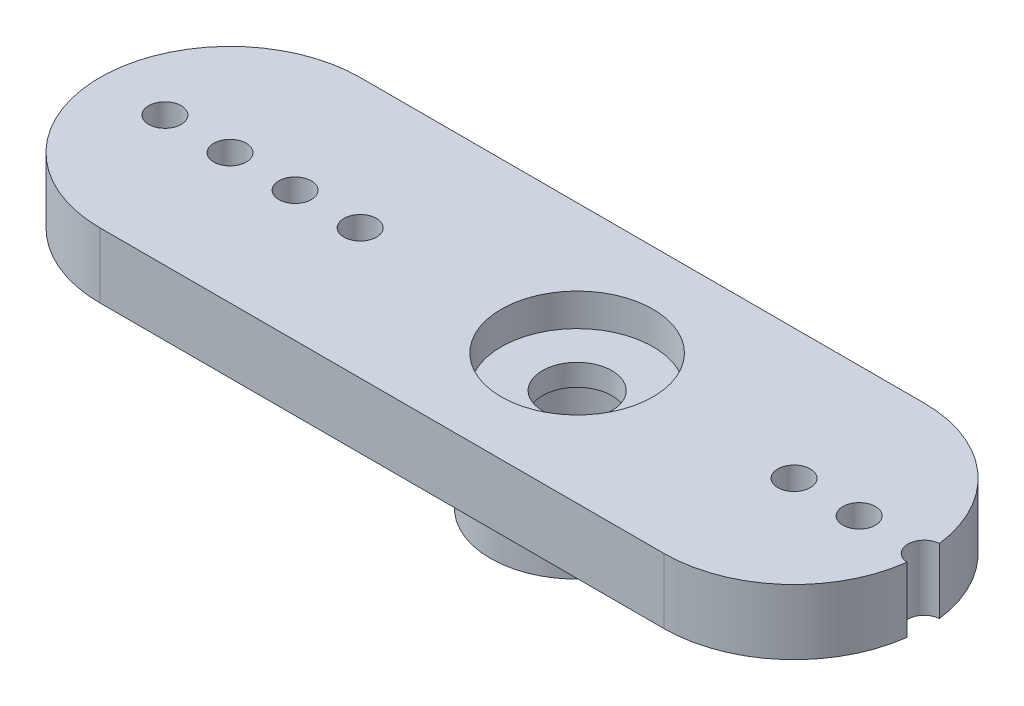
ISO-10303-21;
HEADER;
FILE_DESCRIPTION(('STEP AP214'),'2;1');
FILE_NAME('part.step','',(''),(''),'','','');
FILE_SCHEMA(('AUTOMOTIVE_DESIGN { 1 0 10303 214 1 1 1 1 }'));
ENDSEC;
DATA;
#1=APPLICATION_CONTEXT('core data for automotive mechanical design processes');
#2=APPLICATION_PROTOCOL_DEFINITION('international standard','automotive_design',2000,#1);
#3=PRODUCT_CONTEXT('',#1,'mechanical');
#4=PRODUCT('Part','Part','',(#3));
#5=PRODUCT_RELATED_PRODUCT_CATEGORY('part','',(#4));
#6=PRODUCT_DEFINITION_FORMATION('','',#4);
#7=PRODUCT_DEFINITION_CONTEXT('part definition',#1,'design');
#8=PRODUCT_DEFINITION('design','',#6,#7);
#9=PRODUCT_DEFINITION_SHAPE('','',#8);
#10=(LENGTH_UNIT() NAMED_UNIT(*) SI_UNIT(.MILLI.,.METRE.));
#11=(NAMED_UNIT(*) PLANE_ANGLE_UNIT() SI_UNIT($,.RADIAN.));
#12=(NAMED_UNIT(*) SI_UNIT($,.STERADIAN.) SOLID_ANGLE_UNIT());
#13=UNCERTAINTY_MEASURE_WITH_UNIT(LENGTH_MEASURE(1.E-05),#10,'distance_accuracy_value','');
#14=(GEOMETRIC_REPRESENTATION_CONTEXT(3) GLOBAL_UNCERTAINTY_ASSIGNED_CONTEXT((#13)) GLOBAL_UNIT_ASSIGNED_CONTEXT((#10,
#11,#12)) REPRESENTATION_CONTEXT('',''));
#15=CARTESIAN_POINT('',(0.,0.,0.));
#16=DIRECTION('',(0.,0.,1.));
#17=DIRECTION('',(1.,0.,0.));
#18=AXIS2_PLACEMENT_3D('',#15,#16,#17);
#19=CARTESIAN_POINT('',(-16.,3.,6.));
#20=DIRECTION('',(0.,0.,-1.));
#21=DIRECTION('',(-1.,0.,0.));
#22=AXIS2_PLACEMENT_3D('',#19,#20,#21);
#23=PLANE('',#22);
#24=DIRECTION('',(0.,1.,0.));
#25=VECTOR('',#24,1.);
#26=CARTESIAN_POINT('',(10.,-3.2,6.));
#27=LINE('',#26,#25);
#28=CARTESIAN_POINT('',(10.,0.,6.));
#29=VERTEX_POINT('',#28);
#30=CARTESIAN_POINT('',(10.,3.,6.));
#31=VERTEX_POINT('',#30);
#32=EDGE_CURVE('E88',#29,#31,#27,.T.);
#33=ORIENTED_EDGE('',*,*,#32,.T.);
#34=DIRECTION('',(1.,0.,0.));
#35=VECTOR('',#34,1.);
#36=CARTESIAN_POINT('',(-16.,3.,6.));
#37=LINE('',#36,#35);
#38=CARTESIAN_POINT('',(-16.,3.,6.));
#39=VERTEX_POINT('',#38);
#40=EDGE_CURVE('E97',#39,#31,#37,.T.);
#41=ORIENTED_EDGE('',*,*,#40,.F.);
#42=DIRECTION('',(0.,-1.,0.));
#43=VECTOR('',#42,1.);
#44=CARTESIAN_POINT('',(-16.,3.,6.));
#45=LINE('',#44,#43);
#46=CARTESIAN_POINT('',(-16.,0.,6.));
#47=VERTEX_POINT('',#46);
#48=EDGE_CURVE('E123',#39,#47,#45,.T.);
#49=ORIENTED_EDGE('',*,*,#48,.T.);
#50=DIRECTION('',(1.,0.,0.));
#51=VECTOR('',#50,1.);
#52=CARTESIAN_POINT('',(-16.,0.,6.));
#53=LINE('',#52,#51);
#54=EDGE_CURVE('E99',#47,#29,#53,.T.);
#55=ORIENTED_EDGE('',*,*,#54,.T.);
#56=EDGE_LOOP('',(#33,#41,#49,#55));
#57=FACE_BOUND('',#56,.T.);
#58=ADVANCED_FACE('F35',(#57),#23,.F.);
#59=CARTESIAN_POINT('',(-16.,3.,0.));
#60=DIRECTION('',(0.,-1.,0.));
#61=DIRECTION('',(0.,0.,-1.));
#62=AXIS2_PLACEMENT_3D('',#59,#60,#61);
#63=CYLINDRICAL_SURFACE('',#62,6.);
#64=CARTESIAN_POINT('',(-16.,0.,0.));
#65=DIRECTION('',(0.,1.,0.));
#66=DIRECTION('',(0.,0.,1.));
#67=AXIS2_PLACEMENT_3D('',#64,#65,#66);
#68=CIRCLE('',#67,6.);
#69=CARTESIAN_POINT('',(-16.,0.,-6.));
#70=VERTEX_POINT('',#69);
#71=EDGE_CURVE('E115',#70,#47,#68,.T.);
#72=ORIENTED_EDGE('',*,*,#71,.T.);
#73=ORIENTED_EDGE('',*,*,#48,.F.);
#74=CARTESIAN_POINT('',(-16.,3.,0.));
#75=DIRECTION('',(0.,1.,0.));
#76=DIRECTION('',(0.,0.,1.));
#77=AXIS2_PLACEMENT_3D('',#74,#75,#76);
#78=CIRCLE('',#77,6.);
#79=CARTESIAN_POINT('',(-16.,3.,-6.));
#80=VERTEX_POINT('',#79);
#81=EDGE_CURVE('E105',#80,#39,#78,.T.);
#82=ORIENTED_EDGE('',*,*,#81,.F.);
#83=DIRECTION('',(0.,-1.,0.));
#84=VECTOR('',#83,1.);
#85=CARTESIAN_POINT('',(-16.,3.,-6.));
#86=LINE('',#85,#84);
#87=EDGE_CURVE('E109',#80,#70,#86,.T.);
#88=ORIENTED_EDGE('',*,*,#87,.T.);
#89=EDGE_LOOP('',(#72,#73,#82,#88));
#90=FACE_BOUND('',#89,.T.);
#91=ADVANCED_FACE('F37',(#90),#63,.T.);
#92=CARTESIAN_POINT('',(-16.,3.,-6.));
#93=DIRECTION('',(0.,0.,1.));
#94=DIRECTION('',(1.,0.,0.));
#95=AXIS2_PLACEMENT_3D('',#92,#93,#94);
#96=PLANE('',#95);
#97=DIRECTION('',(-1.,0.,0.));
#98=VECTOR('',#97,1.);
#99=CARTESIAN_POINT('',(-16.,3.,-6.));
#100=LINE('',#99,#98);
#101=CARTESIAN_POINT('',(10.,3.,-6.));
#102=VERTEX_POINT('',#101);
#103=EDGE_CURVE('E107',#102,#80,#100,.T.);
#104=ORIENTED_EDGE('',*,*,#103,.F.);
#105=DIRECTION('',(0.,1.,0.));
#106=VECTOR('',#105,1.);
#107=CARTESIAN_POINT('',(10.,-3.2,-6.));
#108=LINE('',#107,#106);
#109=CARTESIAN_POINT('',(10.,0.,-6.));
#110=VERTEX_POINT('',#109);
#111=EDGE_CURVE('E100',#110,#102,#108,.T.);
#112=ORIENTED_EDGE('',*,*,#111,.F.);
#113=DIRECTION('',(-1.,0.,0.));
#114=VECTOR('',#113,1.);
#115=CARTESIAN_POINT('',(-16.,0.,-6.));
#116=LINE('',#115,#114);
#117=EDGE_CURVE('E111',#110,#70,#116,.T.);
#118=ORIENTED_EDGE('',*,*,#117,.T.);
#119=ORIENTED_EDGE('',*,*,#87,.F.);
#120=EDGE_LOOP('',(#104,#112,#118,#119));
#121=FACE_BOUND('',#120,.T.);
#122=ADVANCED_FACE('F187',(#121),#96,.F.);
#123=CARTESIAN_POINT('',(-16.,3.,0.));
#124=DIRECTION('',(0.,1.,0.));
#125=DIRECTION('',(0.,0.,1.));
#126=AXIS2_PLACEMENT_3D('',#123,#124,#125);
#127=PLANE('',#126);
#128=CARTESIAN_POINT('',(10.,3.,0.));
#129=DIRECTION('',(0.,-1.,0.));
#130=DIRECTION('',(0.,0.,1.));
#131=AXIS2_PLACEMENT_3D('',#128,#129,#130);
#132=CIRCLE('',#131,6.);
#133=CARTESIAN_POINT('',(15.953125,3.,-0.74853372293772));
#134=VERTEX_POINT('',#133);
#135=EDGE_CURVE('E50',#102,#134,#132,.T.);
#136=ORIENTED_EDGE('',*,*,#135,.F.);
#137=ORIENTED_EDGE('',*,*,#103,.T.);
#138=ORIENTED_EDGE('',*,*,#81,.T.);
#139=ORIENTED_EDGE('',*,*,#40,.T.);
#140=CARTESIAN_POINT('',(15.953125,3.,0.748533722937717));
#141=VERTEX_POINT('',#140);
#142=EDGE_CURVE('E85',#141,#31,#132,.T.);
#143=ORIENTED_EDGE('',*,*,#142,.F.);
#144=CARTESIAN_POINT('',(16.,3.,0.));
#145=DIRECTION('',(0.,1.,0.));
#146=DIRECTION('',(0.,0.,1.));
#147=AXIS2_PLACEMENT_3D('',#144,#145,#146);
#148=CIRCLE('',#147,0.750000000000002);
#149=EDGE_CURVE('E130',#134,#141,#148,.T.);
#150=ORIENTED_EDGE('',*,*,#149,.F.);
#151=EDGE_LOOP('',(#136,#137,#138,#139,#143,#150));
#152=FACE_BOUND('',#151,.T.);
#153=CARTESIAN_POINT('',(0.,3.,0.));
#154=DIRECTION('',(0.,1.,0.));
#155=DIRECTION('',(0.,0.,1.));
#156=AXIS2_PLACEMENT_3D('',#153,#154,#155);
#157=CIRCLE('',#156,3.5);
#158=CARTESIAN_POINT('',(0.,3.,3.5));
#159=VERTEX_POINT('',#158);
#160=EDGE_CURVE('E221',#159,#159,#157,.T.);
#161=ORIENTED_EDGE('',*,*,#160,.F.);
#162=EDGE_LOOP('',(#161));
#163=FACE_BOUND('',#162,.T.);
#164=CARTESIAN_POINT('',(-16.,3.,0.));
#165=DIRECTION('',(0.,1.,0.));
#166=DIRECTION('',(0.,0.,1.));
#167=AXIS2_PLACEMENT_3D('',#164,#165,#166);
#168=CIRCLE('',#167,0.750000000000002);
#169=CARTESIAN_POINT('',(-16.,3.,0.750000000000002));
#170=VERTEX_POINT('',#169);
#171=EDGE_CURVE('E151',#170,#170,#168,.T.);
#172=ORIENTED_EDGE('',*,*,#171,.F.);
#173=EDGE_LOOP('',(#172));
#174=FACE_BOUND('',#173,.T.);
#175=CARTESIAN_POINT('',(-13.,3.,0.));
#176=DIRECTION('',(0.,1.,0.));
#177=DIRECTION('',(0.,0.,1.));
#178=AXIS2_PLACEMENT_3D('',#175,#176,#177);
#179=CIRCLE('',#178,0.75);
#180=CARTESIAN_POINT('',(-13.,3.,0.75));
#181=VERTEX_POINT('',#180);
#182=EDGE_CURVE('E162',#181,#181,#179,.T.);
#183=ORIENTED_EDGE('',*,*,#182,.F.);
#184=EDGE_LOOP('',(#183));
#185=FACE_BOUND('',#184,.T.);
#186=CARTESIAN_POINT('',(-10.,3.,0.));
#187=DIRECTION('',(0.,1.,0.));
#188=DIRECTION('',(0.,0.,1.));
#189=AXIS2_PLACEMENT_3D('',#186,#187,#188);
#190=CIRCLE('',#189,0.75);
#191=CARTESIAN_POINT('',(-10.,3.,0.75));
#192=VERTEX_POINT('',#191);
#193=EDGE_CURVE('E168',#192,#192,#190,.T.);
#194=ORIENTED_EDGE('',*,*,#193,.F.);
#195=EDGE_LOOP('',(#194));
#196=FACE_BOUND('',#195,.T.);
#197=CARTESIAN_POINT('',(10.,3.,0.));
#198=DIRECTION('',(0.,1.,0.));
#199=DIRECTION('',(0.,0.,1.));
#200=AXIS2_PLACEMENT_3D('',#197,#198,#199);
#201=CIRCLE('',#200,0.75);
#202=CARTESIAN_POINT('',(10.,3.,0.75));
#203=VERTEX_POINT('',#202);
#204=EDGE_CURVE('E174',#203,#203,#201,.T.);
#205=ORIENTED_EDGE('',*,*,#204,.F.);
#206=EDGE_LOOP('',(#205));
#207=FACE_BOUND('',#206,.T.);
#208=CARTESIAN_POINT('',(13.,3.,0.));
#209=DIRECTION('',(0.,1.,0.));
#210=DIRECTION('',(0.,0.,1.));
#211=AXIS2_PLACEMENT_3D('',#208,#209,#210);
#212=CIRCLE('',#211,0.750000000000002);
#213=CARTESIAN_POINT('',(13.,3.,0.750000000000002));
#214=VERTEX_POINT('',#213);
#215=EDGE_CURVE('E137',#214,#214,#212,.T.);
#216=ORIENTED_EDGE('',*,*,#215,.F.);
#217=EDGE_LOOP('',(#216));
#218=FACE_BOUND('',#217,.T.);
#219=CARTESIAN_POINT('',(-19.,3.,0.));
#220=DIRECTION('',(0.,1.,0.));
#221=DIRECTION('',(0.,0.,1.));
#222=AXIS2_PLACEMENT_3D('',#219,#220,#221);
#223=CIRCLE('',#222,0.750000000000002);
#224=CARTESIAN_POINT('',(-19.,3.,0.750000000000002));
#225=VERTEX_POINT('',#224);
#226=EDGE_CURVE('E145',#225,#225,#223,.T.);
#227=ORIENTED_EDGE('',*,*,#226,.F.);
#228=EDGE_LOOP('',(#227));
#229=FACE_BOUND('',#228,.T.);
#230=ADVANCED_FACE('F102',(#152,#163,#174,#185,#196,#207,#218,#229),#127,.T.);
#231=CARTESIAN_POINT('',(-16.,0.,0.));
#232=DIRECTION('',(0.,1.,0.));
#233=DIRECTION('',(0.,0.,1.));
#234=AXIS2_PLACEMENT_3D('',#231,#232,#233);
#235=PLANE('',#234);
#236=CARTESIAN_POINT('',(0.,0.,0.));
#237=DIRECTION('',(0.,1.,0.));
#238=DIRECTION('',(0.,0.,1.));
#239=AXIS2_PLACEMENT_3D('',#236,#237,#238);
#240=CIRCLE('',#239,4.);
#241=CARTESIAN_POINT('',(0.,0.,4.));
#242=VERTEX_POINT('',#241);
#243=EDGE_CURVE('E125',#242,#242,#240,.F.);
#244=ORIENTED_EDGE('',*,*,#243,.F.);
#245=EDGE_LOOP('',(#244));
#246=FACE_BOUND('',#245,.T.);
#247=CARTESIAN_POINT('',(-16.,0.,0.));
#248=DIRECTION('',(0.,1.,0.));
#249=DIRECTION('',(0.,0.,1.));
#250=AXIS2_PLACEMENT_3D('',#247,#248,#249);
#251=CIRCLE('',#250,0.750000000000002);
#252=CARTESIAN_POINT('',(-16.,0.,0.750000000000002));
#253=VERTEX_POINT('',#252);
#254=EDGE_CURVE('E147',#253,#253,#251,.T.);
#255=ORIENTED_EDGE('',*,*,#254,.T.);
#256=EDGE_LOOP('',(#255));
#257=FACE_BOUND('',#256,.T.);
#258=CARTESIAN_POINT('',(-13.,0.,0.));
#259=DIRECTION('',(0.,1.,0.));
#260=DIRECTION('',(0.,0.,1.));
#261=AXIS2_PLACEMENT_3D('',#258,#259,#260);
#262=CIRCLE('',#261,0.75);
#263=CARTESIAN_POINT('',(-13.,0.,0.75));
#264=VERTEX_POINT('',#263);
#265=EDGE_CURVE('E156',#264,#264,#262,.T.);
#266=ORIENTED_EDGE('',*,*,#265,.T.);
#267=EDGE_LOOP('',(#266));
#268=FACE_BOUND('',#267,.T.);
#269=CARTESIAN_POINT('',(-10.,0.,0.));
#270=DIRECTION('',(0.,1.,0.));
#271=DIRECTION('',(0.,0.,1.));
#272=AXIS2_PLACEMENT_3D('',#269,#270,#271);
#273=CIRCLE('',#272,0.75);
#274=CARTESIAN_POINT('',(-10.,0.,0.75));
#275=VERTEX_POINT('',#274);
#276=EDGE_CURVE('E165',#275,#275,#273,.T.);
#277=ORIENTED_EDGE('',*,*,#276,.T.);
#278=EDGE_LOOP('',(#277));
#279=FACE_BOUND('',#278,.T.);
#280=CARTESIAN_POINT('',(10.,0.,0.));
#281=DIRECTION('',(0.,1.,0.));
#282=DIRECTION('',(0.,0.,1.));
#283=AXIS2_PLACEMENT_3D('',#280,#281,#282);
#284=CIRCLE('',#283,0.75);
#285=CARTESIAN_POINT('',(10.,0.,0.75));
#286=VERTEX_POINT('',#285);
#287=EDGE_CURVE('E171',#286,#286,#284,.T.);
#288=ORIENTED_EDGE('',*,*,#287,.T.);
#289=EDGE_LOOP('',(#288));
#290=FACE_BOUND('',#289,.T.);
#291=CARTESIAN_POINT('',(13.,0.,0.));
#292=DIRECTION('',(0.,1.,0.));
#293=DIRECTION('',(0.,0.,1.));
#294=AXIS2_PLACEMENT_3D('',#291,#292,#293);
#295=CIRCLE('',#294,0.750000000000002);
#296=CARTESIAN_POINT('',(13.,0.,0.750000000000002));
#297=VERTEX_POINT('',#296);
#298=EDGE_CURVE('E177',#297,#297,#295,.T.);
#299=ORIENTED_EDGE('',*,*,#298,.T.);
#300=EDGE_LOOP('',(#299));
#301=FACE_BOUND('',#300,.T.);
#302=ORIENTED_EDGE('',*,*,#117,.F.);
#303=CARTESIAN_POINT('',(10.,0.,0.));
#304=DIRECTION('',(0.,1.,0.));
#305=DIRECTION('',(0.,0.,1.));
#306=AXIS2_PLACEMENT_3D('',#303,#304,#305);
#307=CIRCLE('',#306,6.);
#308=CARTESIAN_POINT('',(15.953125,0.,-0.74853372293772));
#309=VERTEX_POINT('',#308);
#310=EDGE_CURVE('E212',#110,#309,#307,.F.);
#311=ORIENTED_EDGE('',*,*,#310,.T.);
#312=CARTESIAN_POINT('',(16.,0.,0.));
#313=DIRECTION('',(0.,1.,0.));
#314=DIRECTION('',(0.,0.,1.));
#315=AXIS2_PLACEMENT_3D('',#312,#313,#314);
#316=CIRCLE('',#315,0.750000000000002);
#317=CARTESIAN_POINT('',(15.953125,0.,0.74853372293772));
#318=VERTEX_POINT('',#317);
#319=EDGE_CURVE('E132',#309,#318,#316,.T.);
#320=ORIENTED_EDGE('',*,*,#319,.T.);
#321=EDGE_CURVE('E58',#318,#29,#307,.F.);
#322=ORIENTED_EDGE('',*,*,#321,.T.);
#323=ORIENTED_EDGE('',*,*,#54,.F.);
#324=ORIENTED_EDGE('',*,*,#71,.F.);
#325=EDGE_LOOP('',(#302,#311,#320,#322,#323,#324));
#326=FACE_BOUND('',#325,.T.);
#327=CARTESIAN_POINT('',(-19.,0.,0.));
#328=DIRECTION('',(0.,1.,0.));
#329=DIRECTION('',(0.,0.,1.));
#330=AXIS2_PLACEMENT_3D('',#327,#328,#329);
#331=CIRCLE('',#330,0.750000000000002);
#332=CARTESIAN_POINT('',(-19.,0.,0.750000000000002));
#333=VERTEX_POINT('',#332);
#334=EDGE_CURVE('E118',#333,#333,#331,.T.);
#335=ORIENTED_EDGE('',*,*,#334,.T.);
#336=EDGE_LOOP('',(#335));
#337=FACE_BOUND('',#336,.T.);
#338=ADVANCED_FACE('F186',(#246,#257,#268,#279,#290,#301,#326,#337),#235,.F.);
#339=CARTESIAN_POINT('',(-19.,0.,0.));
#340=DIRECTION('',(0.,1.,0.));
#341=DIRECTION('',(0.,0.,1.));
#342=AXIS2_PLACEMENT_3D('',#339,#340,#341);
#343=CYLINDRICAL_SURFACE('',#342,0.750000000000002);
#344=ORIENTED_EDGE('',*,*,#334,.F.);
#345=EDGE_LOOP('',(#344));
#346=FACE_BOUND('',#345,.T.);
#347=ORIENTED_EDGE('',*,*,#226,.T.);
#348=EDGE_LOOP('',(#347));
#349=FACE_BOUND('',#348,.T.);
#350=ADVANCED_FACE('F193',(#346,#349),#343,.F.);
#351=CARTESIAN_POINT('',(16.,0.,0.));
#352=DIRECTION('',(0.,1.,0.));
#353=DIRECTION('',(0.,0.,1.));
#354=AXIS2_PLACEMENT_3D('',#351,#352,#353);
#355=CYLINDRICAL_SURFACE('',#354,0.750000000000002);
#356=ORIENTED_EDGE('',*,*,#149,.T.);
#357=DIRECTION('',(0.,1.,0.));
#358=VECTOR('',#357,1.);
#359=CARTESIAN_POINT('',(15.953125,-0.1,0.74853372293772));
#360=LINE('',#359,#358);
#361=EDGE_CURVE('E11',#141,#318,#360,.F.);
#362=ORIENTED_EDGE('',*,*,#361,.T.);
#363=ORIENTED_EDGE('',*,*,#319,.F.);
#364=DIRECTION('',(0.,1.,0.));
#365=VECTOR('',#364,1.);
#366=CARTESIAN_POINT('',(15.953125,-0.1,-0.74853372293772));
#367=LINE('',#366,#365);
#368=EDGE_CURVE('E43',#309,#134,#367,.T.);
#369=ORIENTED_EDGE('',*,*,#368,.T.);
#370=EDGE_LOOP('',(#356,#362,#363,#369));
#371=FACE_BOUND('',#370,.T.);
#372=ADVANCED_FACE('F129',(#371),#355,.F.);
#373=CARTESIAN_POINT('',(13.,0.,0.));
#374=DIRECTION('',(0.,1.,0.));
#375=DIRECTION('',(0.,0.,1.));
#376=AXIS2_PLACEMENT_3D('',#373,#374,#375);
#377=CYLINDRICAL_SURFACE('',#376,0.750000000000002);
#378=ORIENTED_EDGE('',*,*,#298,.F.);
#379=EDGE_LOOP('',(#378));
#380=FACE_BOUND('',#379,.T.);
#381=ORIENTED_EDGE('',*,*,#215,.T.);
#382=EDGE_LOOP('',(#381));
#383=FACE_BOUND('',#382,.T.);
#384=ADVANCED_FACE('F182',(#380,#383),#377,.F.);
#385=CARTESIAN_POINT('',(10.,0.,0.));
#386=DIRECTION('',(0.,1.,0.));
#387=DIRECTION('',(0.,0.,1.));
#388=AXIS2_PLACEMENT_3D('',#385,#386,#387);
#389=CYLINDRICAL_SURFACE('',#388,0.75);
#390=ORIENTED_EDGE('',*,*,#287,.F.);
#391=EDGE_LOOP('',(#390));
#392=FACE_BOUND('',#391,.T.);
#393=ORIENTED_EDGE('',*,*,#204,.T.);
#394=EDGE_LOOP('',(#393));
#395=FACE_BOUND('',#394,.T.);
#396=ADVANCED_FACE('F256',(#392,#395),#389,.F.);
#397=CARTESIAN_POINT('',(-10.,0.,0.));
#398=DIRECTION('',(0.,1.,0.));
#399=DIRECTION('',(0.,0.,1.));
#400=AXIS2_PLACEMENT_3D('',#397,#398,#399);
#401=CYLINDRICAL_SURFACE('',#400,0.75);
#402=ORIENTED_EDGE('',*,*,#276,.F.);
#403=EDGE_LOOP('',(#402));
#404=FACE_BOUND('',#403,.T.);
#405=ORIENTED_EDGE('',*,*,#193,.T.);
#406=EDGE_LOOP('',(#405));
#407=FACE_BOUND('',#406,.T.);
#408=ADVANCED_FACE('F262',(#404,#407),#401,.F.);
#409=CARTESIAN_POINT('',(-13.,0.,0.));
#410=DIRECTION('',(0.,1.,0.));
#411=DIRECTION('',(0.,0.,1.));
#412=AXIS2_PLACEMENT_3D('',#409,#410,#411);
#413=CYLINDRICAL_SURFACE('',#412,0.75);
#414=ORIENTED_EDGE('',*,*,#265,.F.);
#415=EDGE_LOOP('',(#414));
#416=FACE_BOUND('',#415,.T.);
#417=ORIENTED_EDGE('',*,*,#182,.T.);
#418=EDGE_LOOP('',(#417));
#419=FACE_BOUND('',#418,.T.);
#420=ADVANCED_FACE('F324',(#416,#419),#413,.F.);
#421=CARTESIAN_POINT('',(-16.,0.,0.));
#422=DIRECTION('',(0.,1.,0.));
#423=DIRECTION('',(0.,0.,1.));
#424=AXIS2_PLACEMENT_3D('',#421,#422,#423);
#425=CYLINDRICAL_SURFACE('',#424,0.750000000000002);
#426=ORIENTED_EDGE('',*,*,#254,.F.);
#427=EDGE_LOOP('',(#426));
#428=FACE_BOUND('',#427,.T.);
#429=ORIENTED_EDGE('',*,*,#171,.T.);
#430=EDGE_LOOP('',(#429));
#431=FACE_BOUND('',#430,.T.);
#432=ADVANCED_FACE('F243',(#428,#431),#425,.F.);
#433=CARTESIAN_POINT('',(0.,-3.2,0.));
#434=DIRECTION('',(0.,1.,0.));
#435=DIRECTION('',(0.,0.,1.));
#436=AXIS2_PLACEMENT_3D('',#433,#434,#435);
#437=CYLINDRICAL_SURFACE('',#436,4.);
#438=CARTESIAN_POINT('',(0.,-3.2,0.));
#439=DIRECTION('',(0.,-1.,0.));
#440=DIRECTION('',(0.,0.,-1.));
#441=AXIS2_PLACEMENT_3D('',#438,#439,#440);
#442=CIRCLE('',#441,4.);
#443=CARTESIAN_POINT('',(0.,-3.2,-4.));
#444=VERTEX_POINT('',#443);
#445=EDGE_CURVE('E135',#444,#444,#442,.T.);
#446=ORIENTED_EDGE('',*,*,#445,.F.);
#447=EDGE_LOOP('',(#446));
#448=FACE_BOUND('',#447,.T.);
#449=ORIENTED_EDGE('',*,*,#243,.T.);
#450=EDGE_LOOP('',(#449));
#451=FACE_BOUND('',#450,.T.);
#452=ADVANCED_FACE('F237',(#448,#451),#437,.T.);
#453=CARTESIAN_POINT('',(0.,-3.2,0.));
#454=DIRECTION('',(0.,-1.,0.));
#455=DIRECTION('',(0.,0.,-1.));
#456=AXIS2_PLACEMENT_3D('',#453,#454,#455);
#457=PLANE('',#456);
#458=CARTESIAN_POINT('',(0.,-3.2,0.));
#459=DIRECTION('',(0.,-1.,0.));
#460=DIRECTION('',(0.,0.,-1.));
#461=AXIS2_PLACEMENT_3D('',#458,#459,#460);
#462=CIRCLE('',#461,2.75);
#463=CARTESIAN_POINT('',(0.,-3.2,-2.75));
#464=VERTEX_POINT('',#463);
#465=EDGE_CURVE('E225',#464,#464,#462,.T.);
#466=ORIENTED_EDGE('',*,*,#465,.F.);
#467=EDGE_LOOP('',(#466));
#468=FACE_BOUND('',#467,.T.);
#469=ORIENTED_EDGE('',*,*,#445,.T.);
#470=EDGE_LOOP('',(#469));
#471=FACE_BOUND('',#470,.T.);
#472=ADVANCED_FACE('F234',(#468,#471),#457,.T.);
#473=CARTESIAN_POINT('',(0.,0.5,0.));
#474=DIRECTION('',(0.,-1.,0.));
#475=DIRECTION('',(0.,0.,-1.));
#476=AXIS2_PLACEMENT_3D('',#473,#474,#475);
#477=CYLINDRICAL_SURFACE('',#476,2.75);
#478=CARTESIAN_POINT('',(0.,0.5,0.));
#479=DIRECTION('',(0.,-1.,0.));
#480=DIRECTION('',(0.,0.,-1.));
#481=AXIS2_PLACEMENT_3D('',#478,#479,#480);
#482=CIRCLE('',#481,2.75);
#483=CARTESIAN_POINT('',(0.,0.5,-2.75));
#484=VERTEX_POINT('',#483);
#485=EDGE_CURVE('E140',#484,#484,#482,.T.);
#486=ORIENTED_EDGE('',*,*,#485,.F.);
#487=EDGE_LOOP('',(#486));
#488=FACE_BOUND('',#487,.T.);
#489=ORIENTED_EDGE('',*,*,#465,.T.);
#490=EDGE_LOOP('',(#489));
#491=FACE_BOUND('',#490,.T.);
#492=ADVANCED_FACE('F232',(#488,#491),#477,.F.);
#493=CARTESIAN_POINT('',(0.,0.5,0.));
#494=DIRECTION('',(0.,-1.,0.));
#495=DIRECTION('',(0.,0.,-1.));
#496=AXIS2_PLACEMENT_3D('',#493,#494,#495);
#497=PLANE('',#496);
#498=CARTESIAN_POINT('',(0.,0.5,0.));
#499=DIRECTION('',(0.,-1.,0.));
#500=DIRECTION('',(0.,0.,-1.));
#501=AXIS2_PLACEMENT_3D('',#498,#499,#500);
#502=CIRCLE('',#501,1.6);
#503=CARTESIAN_POINT('',(0.,0.5,-1.6));
#504=VERTEX_POINT('',#503);
#505=EDGE_CURVE('E215',#504,#504,#502,.T.);
#506=ORIENTED_EDGE('',*,*,#505,.F.);
#507=EDGE_LOOP('',(#506));
#508=FACE_BOUND('',#507,.T.);
#509=ORIENTED_EDGE('',*,*,#485,.T.);
#510=EDGE_LOOP('',(#509));
#511=FACE_BOUND('',#510,.T.);
#512=ADVANCED_FACE('F314',(#508,#511),#497,.T.);
#513=CARTESIAN_POINT('',(0.,1.5,0.));
#514=DIRECTION('',(0.,1.,0.));
#515=DIRECTION('',(0.,0.,1.));
#516=AXIS2_PLACEMENT_3D('',#513,#514,#515);
#517=CYLINDRICAL_SURFACE('',#516,3.5);
#518=CARTESIAN_POINT('',(0.,1.5,0.));
#519=DIRECTION('',(0.,1.,0.));
#520=DIRECTION('',(0.,0.,1.));
#521=AXIS2_PLACEMENT_3D('',#518,#519,#520);
#522=CIRCLE('',#521,3.5);
#523=CARTESIAN_POINT('',(0.,1.5,3.5));
#524=VERTEX_POINT('',#523);
#525=EDGE_CURVE('E222',#524,#524,#522,.T.);
#526=ORIENTED_EDGE('',*,*,#525,.F.);
#527=EDGE_LOOP('',(#526));
#528=FACE_BOUND('',#527,.T.);
#529=ORIENTED_EDGE('',*,*,#160,.T.);
#530=EDGE_LOOP('',(#529));
#531=FACE_BOUND('',#530,.T.);
#532=ADVANCED_FACE('F310',(#528,#531),#517,.F.);
#533=CARTESIAN_POINT('',(0.,1.5,0.));
#534=DIRECTION('',(0.,1.,0.));
#535=DIRECTION('',(0.,0.,1.));
#536=AXIS2_PLACEMENT_3D('',#533,#534,#535);
#537=PLANE('',#536);
#538=CARTESIAN_POINT('',(0.,1.5,0.));
#539=DIRECTION('',(0.,1.,0.));
#540=DIRECTION('',(0.,0.,1.));
#541=AXIS2_PLACEMENT_3D('',#538,#539,#540);
#542=CIRCLE('',#541,1.6);
#543=CARTESIAN_POINT('',(0.,1.5,1.6));
#544=VERTEX_POINT('',#543);
#545=EDGE_CURVE('E211',#544,#544,#542,.T.);
#546=ORIENTED_EDGE('',*,*,#545,.F.);
#547=EDGE_LOOP('',(#546));
#548=FACE_BOUND('',#547,.T.);
#549=ORIENTED_EDGE('',*,*,#525,.T.);
#550=EDGE_LOOP('',(#549));
#551=FACE_BOUND('',#550,.T.);
#552=ADVANCED_FACE('F306',(#548,#551),#537,.T.);
#553=CARTESIAN_POINT('',(0.,-3.2,0.));
#554=DIRECTION('',(0.,1.,0.));
#555=DIRECTION('',(0.,0.,1.));
#556=AXIS2_PLACEMENT_3D('',#553,#554,#555);
#557=CYLINDRICAL_SURFACE('',#556,1.6);
#558=ORIENTED_EDGE('',*,*,#505,.T.);
#559=EDGE_LOOP('',(#558));
#560=FACE_BOUND('',#559,.T.);
#561=ORIENTED_EDGE('',*,*,#545,.T.);
#562=EDGE_LOOP('',(#561));
#563=FACE_BOUND('',#562,.T.);
#564=ADVANCED_FACE('F291',(#560,#563),#557,.F.);
#565=CARTESIAN_POINT('',(10.,-3.2,0.));
#566=DIRECTION('',(0.,1.,0.));
#567=DIRECTION('',(0.,0.,1.));
#568=AXIS2_PLACEMENT_3D('',#565,#566,#567);
#569=CYLINDRICAL_SURFACE('',#568,6.);
#570=ORIENTED_EDGE('',*,*,#111,.T.);
#571=ORIENTED_EDGE('',*,*,#135,.T.);
#572=ORIENTED_EDGE('',*,*,#368,.F.);
#573=ORIENTED_EDGE('',*,*,#310,.F.);
#574=EDGE_LOOP('',(#570,#571,#572,#573));
#575=FACE_BOUND('',#574,.T.);
#576=ADVANCED_FACE('F286',(#575),#569,.T.);
#577=ORIENTED_EDGE('',*,*,#361,.F.);
#578=ORIENTED_EDGE('',*,*,#142,.T.);
#579=ORIENTED_EDGE('',*,*,#32,.F.);
#580=ORIENTED_EDGE('',*,*,#321,.F.);
#581=EDGE_LOOP('',(#577,#578,#579,#580));
#582=FACE_BOUND('',#581,.T.);
#583=ADVANCED_FACE('F87',(#582),#569,.T.);
#584=CLOSED_SHELL('',(#58,#91,#122,#230,#338,#350,#372,#384,#396,#408,#420,#432,#452,#472,#492,
#512,#532,#552,#564,#576,#583));
#585=MANIFOLD_SOLID_BREP('B2',#584);
#586=ADVANCED_BREP_SHAPE_REPRESENTATION('',(#18,#585),#14);
#587=SHAPE_DEFINITION_REPRESENTATION(#9,#586);
ENDSEC;
END-ISO-10303-21;
